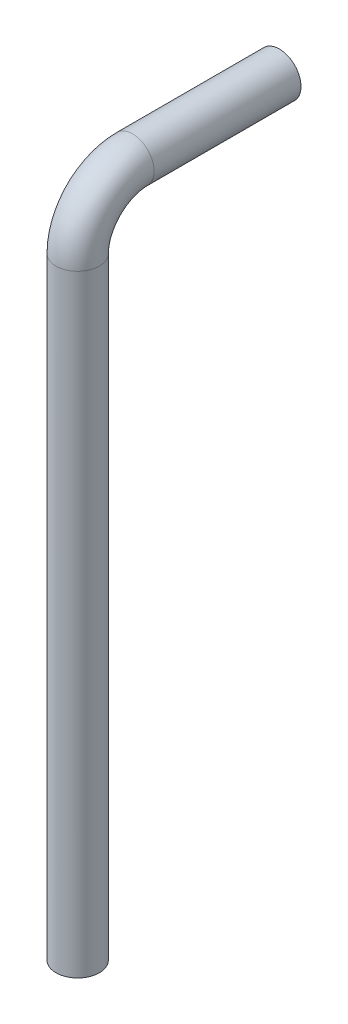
ISO-10303-21;
HEADER;
FILE_DESCRIPTION(('STEP AP214'),'2;1');
FILE_NAME('part.step','',(''),(''),'','','');
FILE_SCHEMA(('AUTOMOTIVE_DESIGN { 1 0 10303 214 1 1 1 1 }'));
ENDSEC;
DATA;
#1=APPLICATION_CONTEXT('core data for automotive mechanical design processes');
#2=APPLICATION_PROTOCOL_DEFINITION('international standard','automotive_design',2000,#1);
#3=PRODUCT_CONTEXT('',#1,'mechanical');
#4=PRODUCT('Part','Part','',(#3));
#5=PRODUCT_RELATED_PRODUCT_CATEGORY('part','',(#4));
#6=PRODUCT_DEFINITION_FORMATION('','',#4);
#7=PRODUCT_DEFINITION_CONTEXT('part definition',#1,'design');
#8=PRODUCT_DEFINITION('design','',#6,#7);
#9=PRODUCT_DEFINITION_SHAPE('','',#8);
#10=(LENGTH_UNIT() NAMED_UNIT(*) SI_UNIT(.MILLI.,.METRE.));
#11=(NAMED_UNIT(*) PLANE_ANGLE_UNIT() SI_UNIT($,.RADIAN.));
#12=(NAMED_UNIT(*) SI_UNIT($,.STERADIAN.) SOLID_ANGLE_UNIT());
#13=UNCERTAINTY_MEASURE_WITH_UNIT(LENGTH_MEASURE(1.E-05),#10,'distance_accuracy_value','');
#14=(GEOMETRIC_REPRESENTATION_CONTEXT(3) GLOBAL_UNCERTAINTY_ASSIGNED_CONTEXT((#13)) GLOBAL_UNIT_ASSIGNED_CONTEXT((#10,
#11,#12)) REPRESENTATION_CONTEXT('',''));
#15=CARTESIAN_POINT('',(0.,0.,0.));
#16=DIRECTION('',(0.,0.,1.));
#17=DIRECTION('',(1.,0.,0.));
#18=AXIS2_PLACEMENT_3D('',#15,#16,#17);
#19=CARTESIAN_POINT('',(0.,-76.,280.));
#20=DIRECTION('',(0.,-1.,0.));
#21=DIRECTION('',(0.,0.,-1.));
#22=AXIS2_PLACEMENT_3D('',#19,#20,#21);
#23=CYLINDRICAL_SURFACE('',#22,30.15);
#24=CARTESIAN_POINT('',(0.,-76.,280.));
#25=DIRECTION('',(0.,-1.,0.));
#26=DIRECTION('',(1.,0.,0.));
#27=AXIS2_PLACEMENT_3D('',#24,#25,#26);
#28=CIRCLE('',#27,30.15);
#29=CARTESIAN_POINT('',(0.,-76.,310.15));
#30=VERTEX_POINT('',#29);
#31=EDGE_CURVE('E40',#30,#30,#28,.T.);
#32=ORIENTED_EDGE('',*,*,#31,.T.);
#33=EDGE_LOOP('',(#32));
#34=FACE_BOUND('',#33,.T.);
#35=CARTESIAN_POINT('',(0.,-926.,280.));
#36=DIRECTION('',(0.,-1.,0.));
#37=DIRECTION('',(1.,0.,0.));
#38=AXIS2_PLACEMENT_3D('',#35,#36,#37);
#39=CIRCLE('',#38,30.15);
#40=CARTESIAN_POINT('',(30.15,-926.,280.));
#41=VERTEX_POINT('',#40);
#42=EDGE_CURVE('E10',#41,#41,#39,.T.);
#43=ORIENTED_EDGE('',*,*,#42,.F.);
#44=EDGE_LOOP('',(#43));
#45=FACE_BOUND('',#44,.T.);
#46=ADVANCED_FACE('F30',(#34,#45),#23,.T.);
#47=CARTESIAN_POINT('',(0.,-76.,280.));
#48=DIRECTION('',(0.,-1.,0.));
#49=DIRECTION('',(0.,0.,-1.));
#50=AXIS2_PLACEMENT_3D('',#47,#48,#49);
#51=CYLINDRICAL_SURFACE('',#50,28.15);
#52=CARTESIAN_POINT('',(0.,-76.,280.));
#53=DIRECTION('',(0.,-1.,0.));
#54=DIRECTION('',(1.,0.,0.));
#55=AXIS2_PLACEMENT_3D('',#52,#53,#54);
#56=CIRCLE('',#55,28.15);
#57=CARTESIAN_POINT('',(0.,-76.,308.15));
#58=VERTEX_POINT('',#57);
#59=EDGE_CURVE('E44',#58,#58,#56,.T.);
#60=ORIENTED_EDGE('',*,*,#59,.F.);
#61=EDGE_LOOP('',(#60));
#62=FACE_BOUND('',#61,.T.);
#63=CARTESIAN_POINT('',(0.,-926.,280.));
#64=DIRECTION('',(0.,-1.,0.));
#65=DIRECTION('',(1.,0.,0.));
#66=AXIS2_PLACEMENT_3D('',#63,#64,#65);
#67=CIRCLE('',#66,28.15);
#68=CARTESIAN_POINT('',(28.15,-926.,280.));
#69=VERTEX_POINT('',#68);
#70=EDGE_CURVE('E36',#69,#69,#67,.T.);
#71=ORIENTED_EDGE('',*,*,#70,.T.);
#72=EDGE_LOOP('',(#71));
#73=FACE_BOUND('',#72,.T.);
#74=ADVANCED_FACE('F72',(#62,#73),#51,.F.);
#75=CARTESIAN_POINT('',(0.,-76.,204.));
#76=DIRECTION('',(1.,0.,0.));
#77=DIRECTION('',(0.,0.,-1.));
#78=AXIS2_PLACEMENT_3D('',#75,#76,#77);
#79=TOROIDAL_SURFACE('',#78,76.,30.15);
#80=CARTESIAN_POINT('',(0.,0.,204.));
#81=DIRECTION('',(0.,0.,1.));
#82=DIRECTION('',(1.,0.,0.));
#83=AXIS2_PLACEMENT_3D('',#80,#81,#82);
#84=CIRCLE('',#83,30.15);
#85=CARTESIAN_POINT('',(0.,30.15,204.));
#86=VERTEX_POINT('',#85);
#87=EDGE_CURVE('E49',#86,#86,#84,.T.);
#88=CARTESIAN_POINT('',(0.,-76.,204.));
#89=DIRECTION('',(1.,0.,0.));
#90=DIRECTION('',(0.,0.,-1.));
#91=AXIS2_PLACEMENT_3D('',#88,#89,#90);
#92=CIRCLE('',#91,106.15);
#93=EDGE_CURVE('',#86,#30,#92,.T.);
#94=ORIENTED_EDGE('',*,*,#87,.T.);
#95=ORIENTED_EDGE('',*,*,#31,.F.);
#96=ORIENTED_EDGE('',*,*,#93,.T.);
#97=ORIENTED_EDGE('',*,*,#93,.F.);
#98=EDGE_LOOP('',(#94,#96,#95,#97));
#99=FACE_BOUND('',#98,.T.);
#100=ADVANCED_FACE('F68',(#99),#79,.T.);
#101=CARTESIAN_POINT('',(0.,-76.,204.));
#102=DIRECTION('',(1.,0.,0.));
#103=DIRECTION('',(0.,0.,-1.));
#104=AXIS2_PLACEMENT_3D('',#101,#102,#103);
#105=TOROIDAL_SURFACE('',#104,76.,28.15);
#106=CARTESIAN_POINT('',(0.,0.,204.));
#107=DIRECTION('',(0.,0.,1.));
#108=DIRECTION('',(1.,0.,0.));
#109=AXIS2_PLACEMENT_3D('',#106,#107,#108);
#110=CIRCLE('',#109,28.15);
#111=CARTESIAN_POINT('',(0.,28.15,204.));
#112=VERTEX_POINT('',#111);
#113=EDGE_CURVE('E53',#112,#112,#110,.T.);
#114=CARTESIAN_POINT('',(0.,-76.,204.));
#115=DIRECTION('',(1.,0.,0.));
#116=DIRECTION('',(0.,0.,-1.));
#117=AXIS2_PLACEMENT_3D('',#114,#115,#116);
#118=CIRCLE('',#117,104.15);
#119=EDGE_CURVE('',#112,#58,#118,.T.);
#120=ORIENTED_EDGE('',*,*,#113,.F.);
#121=ORIENTED_EDGE('',*,*,#59,.T.);
#122=ORIENTED_EDGE('',*,*,#119,.T.);
#123=ORIENTED_EDGE('',*,*,#119,.F.);
#124=EDGE_LOOP('',(#120,#122,#121,#123));
#125=FACE_BOUND('',#124,.T.);
#126=ADVANCED_FACE('F65',(#125),#105,.F.);
#127=CARTESIAN_POINT('',(0.,0.,204.));
#128=DIRECTION('',(0.,0.,-1.));
#129=DIRECTION('',(0.,1.,0.));
#130=AXIS2_PLACEMENT_3D('',#127,#128,#129);
#131=CYLINDRICAL_SURFACE('',#130,28.15);
#132=ORIENTED_EDGE('',*,*,#113,.T.);
#133=EDGE_LOOP('',(#132));
#134=FACE_BOUND('',#133,.T.);
#135=CARTESIAN_POINT('',(0.,0.,0.));
#136=DIRECTION('',(0.,0.,1.));
#137=DIRECTION('',(1.,0.,0.));
#138=AXIS2_PLACEMENT_3D('',#135,#136,#137);
#139=CIRCLE('',#138,28.15);
#140=CARTESIAN_POINT('',(28.15,0.,0.));
#141=VERTEX_POINT('',#140);
#142=EDGE_CURVE('E54',#141,#141,#139,.T.);
#143=ORIENTED_EDGE('',*,*,#142,.F.);
#144=EDGE_LOOP('',(#143));
#145=FACE_BOUND('',#144,.T.);
#146=ADVANCED_FACE('F62',(#134,#145),#131,.F.);
#147=CARTESIAN_POINT('',(0.,0.,204.));
#148=DIRECTION('',(0.,0.,-1.));
#149=DIRECTION('',(0.,1.,0.));
#150=AXIS2_PLACEMENT_3D('',#147,#148,#149);
#151=CYLINDRICAL_SURFACE('',#150,30.15);
#152=ORIENTED_EDGE('',*,*,#87,.F.);
#153=EDGE_LOOP('',(#152));
#154=FACE_BOUND('',#153,.T.);
#155=CARTESIAN_POINT('',(0.,0.,0.));
#156=DIRECTION('',(0.,0.,1.));
#157=DIRECTION('',(1.,0.,0.));
#158=AXIS2_PLACEMENT_3D('',#155,#156,#157);
#159=CIRCLE('',#158,30.15);
#160=CARTESIAN_POINT('',(30.15,0.,0.));
#161=VERTEX_POINT('',#160);
#162=EDGE_CURVE('E50',#161,#161,#159,.T.);
#163=ORIENTED_EDGE('',*,*,#162,.T.);
#164=EDGE_LOOP('',(#163));
#165=FACE_BOUND('',#164,.T.);
#166=ADVANCED_FACE('F84',(#154,#165),#151,.T.);
#167=CARTESIAN_POINT('',(0.,-926.,280.));
#168=DIRECTION('',(0.,-1.,0.));
#169=DIRECTION('',(1.,0.,0.));
#170=AXIS2_PLACEMENT_3D('',#167,#168,#169);
#171=PLANE('',#170);
#172=ORIENTED_EDGE('',*,*,#70,.F.);
#173=EDGE_LOOP('',(#172));
#174=FACE_BOUND('',#173,.T.);
#175=ORIENTED_EDGE('',*,*,#42,.T.);
#176=EDGE_LOOP('',(#175));
#177=FACE_BOUND('',#176,.T.);
#178=ADVANCED_FACE('F87',(#174,#177),#171,.T.);
#179=CARTESIAN_POINT('',(0.,0.,0.));
#180=DIRECTION('',(0.,0.,1.));
#181=DIRECTION('',(1.,0.,0.));
#182=AXIS2_PLACEMENT_3D('',#179,#180,#181);
#183=PLANE('',#182);
#184=ORIENTED_EDGE('',*,*,#142,.T.);
#185=EDGE_LOOP('',(#184));
#186=FACE_BOUND('',#185,.T.);
#187=ORIENTED_EDGE('',*,*,#162,.F.);
#188=EDGE_LOOP('',(#187));
#189=FACE_BOUND('',#188,.T.);
#190=ADVANCED_FACE('F89',(#186,#189),#183,.F.);
#191=CLOSED_SHELL('',(#46,#74,#100,#126,#146,#166,#178,#190));
#192=MANIFOLD_SOLID_BREP('B2',#191);
#193=ADVANCED_BREP_SHAPE_REPRESENTATION('',(#18,#192),#14);
#194=SHAPE_DEFINITION_REPRESENTATION(#9,#193);
ENDSEC;
END-ISO-10303-21;
